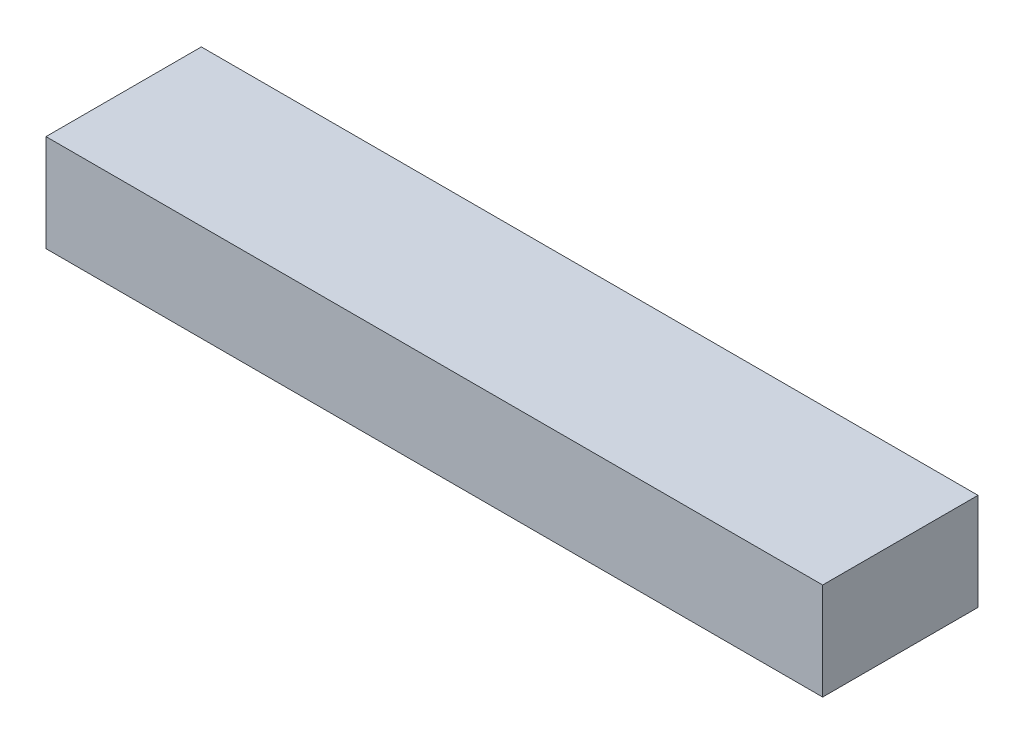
from build123d import *

# Parameters (mm, degrees)
ESQUISSE1_W      = 40
ESQUISSE1_H      = 5
EXTRUSION1_DEPTH = 8


with BuildPart() as part:
    # Esquisse1 → Extrusion1 (new body)
    with BuildSketch(Plane.XY):
        with Locations((20, 2.5)):
            Rectangle(ESQUISSE1_W, ESQUISSE1_H)
    extrude(amount=EXTRUSION1_DEPTH)


solid = part.part
